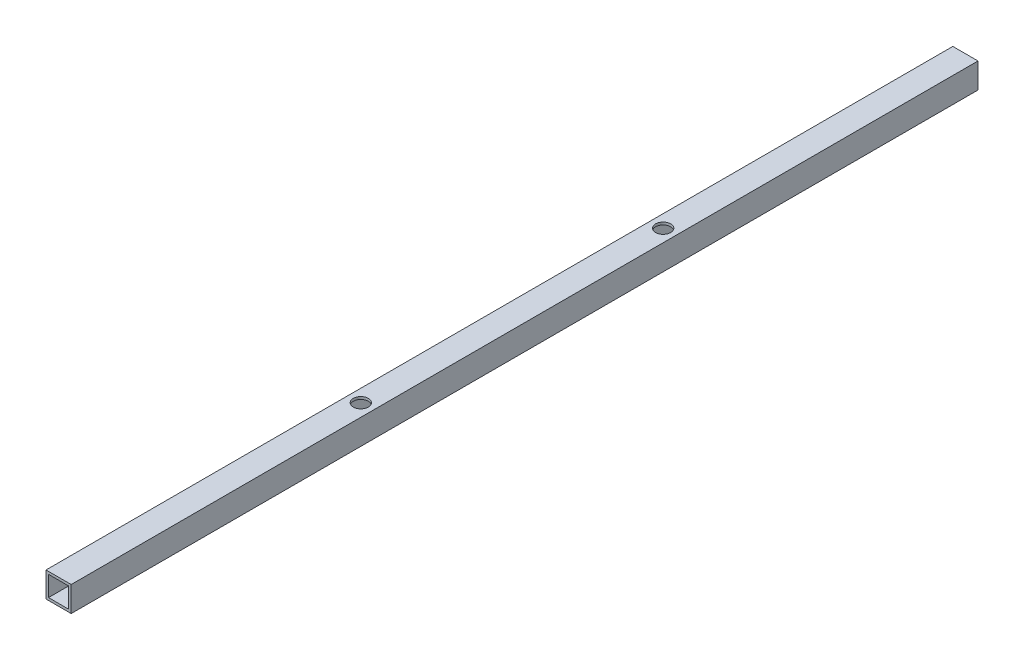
ISO-10303-21;
HEADER;
FILE_DESCRIPTION(('STEP AP214'),'2;1');
FILE_NAME('part.step','',(''),(''),'','','');
FILE_SCHEMA(('AUTOMOTIVE_DESIGN { 1 0 10303 214 1 1 1 1 }'));
ENDSEC;
DATA;
#1=APPLICATION_CONTEXT('core data for automotive mechanical design processes');
#2=APPLICATION_PROTOCOL_DEFINITION('international standard','automotive_design',2000,#1);
#3=PRODUCT_CONTEXT('',#1,'mechanical');
#4=PRODUCT('Part','Part','',(#3));
#5=PRODUCT_RELATED_PRODUCT_CATEGORY('part','',(#4));
#6=PRODUCT_DEFINITION_FORMATION('','',#4);
#7=PRODUCT_DEFINITION_CONTEXT('part definition',#1,'design');
#8=PRODUCT_DEFINITION('design','',#6,#7);
#9=PRODUCT_DEFINITION_SHAPE('','',#8);
#10=(LENGTH_UNIT() NAMED_UNIT(*) SI_UNIT(.MILLI.,.METRE.));
#11=(NAMED_UNIT(*) PLANE_ANGLE_UNIT() SI_UNIT($,.RADIAN.));
#12=(NAMED_UNIT(*) SI_UNIT($,.STERADIAN.) SOLID_ANGLE_UNIT());
#13=UNCERTAINTY_MEASURE_WITH_UNIT(LENGTH_MEASURE(1.E-05),#10,'distance_accuracy_value','');
#14=(GEOMETRIC_REPRESENTATION_CONTEXT(3) GLOBAL_UNCERTAINTY_ASSIGNED_CONTEXT((#13)) GLOBAL_UNIT_ASSIGNED_CONTEXT((#10,
#11,#12)) REPRESENTATION_CONTEXT('',''));
#15=CARTESIAN_POINT('',(0.,0.,0.));
#16=DIRECTION('',(0.,0.,1.));
#17=DIRECTION('',(1.,0.,0.));
#18=AXIS2_PLACEMENT_3D('',#15,#16,#17);
#19=CARTESIAN_POINT('',(4.99999999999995,5.00000000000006,360.));
#20=DIRECTION('',(-1.,0.,0.));
#21=DIRECTION('',(0.,-1.,0.));
#22=AXIS2_PLACEMENT_3D('',#19,#20,#21);
#23=PLANE('',#22);
#24=DIRECTION('',(0.,1.,0.));
#25=VECTOR('',#24,1.);
#26=CARTESIAN_POINT('',(4.99999999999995,5.00000000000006,0.));
#27=LINE('',#26,#25);
#28=CARTESIAN_POINT('',(4.99999999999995,-4.99999999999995,0.));
#29=VERTEX_POINT('',#28);
#30=CARTESIAN_POINT('',(4.99999999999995,5.00000000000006,0.));
#31=VERTEX_POINT('',#30);
#32=EDGE_CURVE('E151',#29,#31,#27,.T.);
#33=ORIENTED_EDGE('',*,*,#32,.T.);
#34=DIRECTION('',(0.,0.,-1.));
#35=VECTOR('',#34,1.);
#36=CARTESIAN_POINT('',(4.99999999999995,5.00000000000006,360.));
#37=LINE('',#36,#35);
#38=CARTESIAN_POINT('',(4.99999999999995,5.00000000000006,360.));
#39=VERTEX_POINT('',#38);
#40=EDGE_CURVE('E11',#39,#31,#37,.T.);
#41=ORIENTED_EDGE('',*,*,#40,.F.);
#42=DIRECTION('',(0.,1.,0.));
#43=VECTOR('',#42,1.);
#44=CARTESIAN_POINT('',(4.99999999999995,5.00000000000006,360.));
#45=LINE('',#44,#43);
#46=CARTESIAN_POINT('',(4.99999999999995,-4.99999999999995,360.));
#47=VERTEX_POINT('',#46);
#48=EDGE_CURVE('E157',#47,#39,#45,.T.);
#49=ORIENTED_EDGE('',*,*,#48,.F.);
#50=DIRECTION('',(0.,0.,-1.));
#51=VECTOR('',#50,1.);
#52=CARTESIAN_POINT('',(4.99999999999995,-4.99999999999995,360.));
#53=LINE('',#52,#51);
#54=EDGE_CURVE('E171',#47,#29,#53,.T.);
#55=ORIENTED_EDGE('',*,*,#54,.T.);
#56=EDGE_LOOP('',(#33,#41,#49,#55));
#57=FACE_BOUND('',#56,.T.);
#58=ADVANCED_FACE('F39',(#57),#23,.F.);
#59=CARTESIAN_POINT('',(-5.00000000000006,5.00000000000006,360.));
#60=DIRECTION('',(0.,-1.,0.));
#61=DIRECTION('',(0.,0.,-1.));
#62=AXIS2_PLACEMENT_3D('',#59,#60,#61);
#63=PLANE('',#62);
#64=CARTESIAN_POINT('',(0.,5.00000000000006,120.));
#65=DIRECTION('',(0.,1.,0.));
#66=DIRECTION('',(0.,0.,1.));
#67=AXIS2_PLACEMENT_3D('',#64,#65,#66);
#68=CIRCLE('',#67,3.);
#69=CARTESIAN_POINT('',(0.,5.00000000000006,123.));
#70=VERTEX_POINT('',#69);
#71=EDGE_CURVE('E142',#70,#70,#68,.T.);
#72=ORIENTED_EDGE('',*,*,#71,.F.);
#73=EDGE_LOOP('',(#72));
#74=FACE_BOUND('',#73,.T.);
#75=CARTESIAN_POINT('',(0.,5.00000000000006,240.));
#76=DIRECTION('',(0.,1.,0.));
#77=DIRECTION('',(0.,0.,1.));
#78=AXIS2_PLACEMENT_3D('',#75,#76,#77);
#79=CIRCLE('',#78,3.);
#80=CARTESIAN_POINT('',(0.,5.00000000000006,243.));
#81=VERTEX_POINT('',#80);
#82=EDGE_CURVE('E132',#81,#81,#79,.T.);
#83=ORIENTED_EDGE('',*,*,#82,.F.);
#84=EDGE_LOOP('',(#83));
#85=FACE_BOUND('',#84,.T.);
#86=DIRECTION('',(-1.,0.,0.));
#87=VECTOR('',#86,1.);
#88=CARTESIAN_POINT('',(-5.00000000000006,5.00000000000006,0.));
#89=LINE('',#88,#87);
#90=CARTESIAN_POINT('',(-5.00000000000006,5.00000000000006,0.));
#91=VERTEX_POINT('',#90);
#92=EDGE_CURVE('E175',#31,#91,#89,.T.);
#93=ORIENTED_EDGE('',*,*,#92,.T.);
#94=DIRECTION('',(0.,0.,-1.));
#95=VECTOR('',#94,1.);
#96=CARTESIAN_POINT('',(-5.00000000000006,5.00000000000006,360.));
#97=LINE('',#96,#95);
#98=CARTESIAN_POINT('',(-5.00000000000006,5.00000000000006,360.));
#99=VERTEX_POINT('',#98);
#100=EDGE_CURVE('E47',#99,#91,#97,.T.);
#101=ORIENTED_EDGE('',*,*,#100,.F.);
#102=DIRECTION('',(-1.,0.,0.));
#103=VECTOR('',#102,1.);
#104=CARTESIAN_POINT('',(-5.00000000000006,5.00000000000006,360.));
#105=LINE('',#104,#103);
#106=EDGE_CURVE('E161',#39,#99,#105,.T.);
#107=ORIENTED_EDGE('',*,*,#106,.F.);
#108=ORIENTED_EDGE('',*,*,#40,.T.);
#109=EDGE_LOOP('',(#93,#101,#107,#108));
#110=FACE_BOUND('',#109,.T.);
#111=ADVANCED_FACE('F209',(#74,#85,#110),#63,.F.);
#112=CARTESIAN_POINT('',(-5.00000000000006,5.00000000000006,360.));
#113=DIRECTION('',(1.,0.,0.));
#114=DIRECTION('',(0.,1.,0.));
#115=AXIS2_PLACEMENT_3D('',#112,#113,#114);
#116=PLANE('',#115);
#117=DIRECTION('',(0.,-1.,0.));
#118=VECTOR('',#117,1.);
#119=CARTESIAN_POINT('',(-5.00000000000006,5.00000000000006,0.));
#120=LINE('',#119,#118);
#121=CARTESIAN_POINT('',(-5.00000000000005,-4.99999999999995,0.));
#122=VERTEX_POINT('',#121);
#123=EDGE_CURVE('E178',#91,#122,#120,.T.);
#124=ORIENTED_EDGE('',*,*,#123,.T.);
#125=DIRECTION('',(0.,0.,-1.));
#126=VECTOR('',#125,1.);
#127=CARTESIAN_POINT('',(-5.00000000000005,-4.99999999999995,360.));
#128=LINE('',#127,#126);
#129=CARTESIAN_POINT('',(-5.00000000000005,-4.99999999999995,360.));
#130=VERTEX_POINT('',#129);
#131=EDGE_CURVE('E186',#130,#122,#128,.T.);
#132=ORIENTED_EDGE('',*,*,#131,.F.);
#133=DIRECTION('',(0.,-1.,0.));
#134=VECTOR('',#133,1.);
#135=CARTESIAN_POINT('',(-5.00000000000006,5.00000000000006,360.));
#136=LINE('',#135,#134);
#137=EDGE_CURVE('E165',#99,#130,#136,.T.);
#138=ORIENTED_EDGE('',*,*,#137,.F.);
#139=ORIENTED_EDGE('',*,*,#100,.T.);
#140=EDGE_LOOP('',(#124,#132,#138,#139));
#141=FACE_BOUND('',#140,.T.);
#142=ADVANCED_FACE('F195',(#141),#116,.F.);
#143=CARTESIAN_POINT('',(-5.00000000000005,-4.99999999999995,360.));
#144=DIRECTION('',(0.,1.,0.));
#145=DIRECTION('',(0.,0.,1.));
#146=AXIS2_PLACEMENT_3D('',#143,#144,#145);
#147=PLANE('',#146);
#148=DIRECTION('',(1.,0.,0.));
#149=VECTOR('',#148,1.);
#150=CARTESIAN_POINT('',(-5.00000000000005,-4.99999999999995,0.));
#151=LINE('',#150,#149);
#152=EDGE_CURVE('E162',#122,#29,#151,.T.);
#153=ORIENTED_EDGE('',*,*,#152,.T.);
#154=ORIENTED_EDGE('',*,*,#54,.F.);
#155=DIRECTION('',(1.,0.,0.));
#156=VECTOR('',#155,1.);
#157=CARTESIAN_POINT('',(-5.00000000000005,-4.99999999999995,360.));
#158=LINE('',#157,#156);
#159=EDGE_CURVE('E168',#130,#47,#158,.T.);
#160=ORIENTED_EDGE('',*,*,#159,.F.);
#161=ORIENTED_EDGE('',*,*,#131,.T.);
#162=EDGE_LOOP('',(#153,#154,#160,#161));
#163=FACE_BOUND('',#162,.T.);
#164=ADVANCED_FACE('F202',(#163),#147,.F.);
#165=CARTESIAN_POINT('',(0.,0.,360.));
#166=DIRECTION('',(0.,0.,1.));
#167=DIRECTION('',(1.,0.,0.));
#168=AXIS2_PLACEMENT_3D('',#165,#166,#167);
#169=PLANE('',#168);
#170=DIRECTION('',(0.,1.,0.));
#171=VECTOR('',#170,1.);
#172=CARTESIAN_POINT('',(4.,4.,360.));
#173=LINE('',#172,#171);
#174=CARTESIAN_POINT('',(4.,-4.,360.));
#175=VERTEX_POINT('',#174);
#176=CARTESIAN_POINT('',(4.,4.,360.));
#177=VERTEX_POINT('',#176);
#178=EDGE_CURVE('E54',#175,#177,#173,.T.);
#179=ORIENTED_EDGE('',*,*,#178,.F.);
#180=DIRECTION('',(1.,0.,0.));
#181=VECTOR('',#180,1.);
#182=CARTESIAN_POINT('',(-4.,-4.,360.));
#183=LINE('',#182,#181);
#184=CARTESIAN_POINT('',(-4.,-4.,360.));
#185=VERTEX_POINT('',#184);
#186=EDGE_CURVE('E125',#185,#175,#183,.T.);
#187=ORIENTED_EDGE('',*,*,#186,.F.);
#188=DIRECTION('',(0.,-1.,0.));
#189=VECTOR('',#188,1.);
#190=CARTESIAN_POINT('',(-4.,4.,360.));
#191=LINE('',#190,#189);
#192=CARTESIAN_POINT('',(-4.,4.,360.));
#193=VERTEX_POINT('',#192);
#194=EDGE_CURVE('E129',#193,#185,#191,.T.);
#195=ORIENTED_EDGE('',*,*,#194,.F.);
#196=DIRECTION('',(-1.,0.,0.));
#197=VECTOR('',#196,1.);
#198=CARTESIAN_POINT('',(-4.,4.,360.));
#199=LINE('',#198,#197);
#200=EDGE_CURVE('E141',#177,#193,#199,.T.);
#201=ORIENTED_EDGE('',*,*,#200,.F.);
#202=EDGE_LOOP('',(#179,#187,#195,#201));
#203=FACE_BOUND('',#202,.T.);
#204=ORIENTED_EDGE('',*,*,#48,.T.);
#205=ORIENTED_EDGE('',*,*,#106,.T.);
#206=ORIENTED_EDGE('',*,*,#137,.T.);
#207=ORIENTED_EDGE('',*,*,#159,.T.);
#208=EDGE_LOOP('',(#204,#205,#206,#207));
#209=FACE_BOUND('',#208,.T.);
#210=ADVANCED_FACE('F208',(#203,#209),#169,.T.);
#211=CARTESIAN_POINT('',(0.,0.,0.));
#212=DIRECTION('',(0.,0.,1.));
#213=DIRECTION('',(1.,0.,0.));
#214=AXIS2_PLACEMENT_3D('',#211,#212,#213);
#215=PLANE('',#214);
#216=DIRECTION('',(1.,0.,0.));
#217=VECTOR('',#216,1.);
#218=CARTESIAN_POINT('',(-4.,-4.,0.));
#219=LINE('',#218,#217);
#220=CARTESIAN_POINT('',(-4.,-4.,0.));
#221=VERTEX_POINT('',#220);
#222=CARTESIAN_POINT('',(4.,-4.,0.));
#223=VERTEX_POINT('',#222);
#224=EDGE_CURVE('E113',#221,#223,#219,.T.);
#225=ORIENTED_EDGE('',*,*,#224,.T.);
#226=DIRECTION('',(0.,1.,0.));
#227=VECTOR('',#226,1.);
#228=CARTESIAN_POINT('',(4.,4.,0.));
#229=LINE('',#228,#227);
#230=CARTESIAN_POINT('',(4.,4.,0.));
#231=VERTEX_POINT('',#230);
#232=EDGE_CURVE('E106',#223,#231,#229,.T.);
#233=ORIENTED_EDGE('',*,*,#232,.T.);
#234=DIRECTION('',(-1.,0.,0.));
#235=VECTOR('',#234,1.);
#236=CARTESIAN_POINT('',(-4.,4.,0.));
#237=LINE('',#236,#235);
#238=CARTESIAN_POINT('',(-4.,4.,0.));
#239=VERTEX_POINT('',#238);
#240=EDGE_CURVE('E116',#231,#239,#237,.T.);
#241=ORIENTED_EDGE('',*,*,#240,.T.);
#242=DIRECTION('',(0.,-1.,0.));
#243=VECTOR('',#242,1.);
#244=CARTESIAN_POINT('',(-4.,4.,0.));
#245=LINE('',#244,#243);
#246=EDGE_CURVE('E62',#239,#221,#245,.T.);
#247=ORIENTED_EDGE('',*,*,#246,.T.);
#248=EDGE_LOOP('',(#225,#233,#241,#247));
#249=FACE_BOUND('',#248,.T.);
#250=ORIENTED_EDGE('',*,*,#32,.F.);
#251=ORIENTED_EDGE('',*,*,#152,.F.);
#252=ORIENTED_EDGE('',*,*,#123,.F.);
#253=ORIENTED_EDGE('',*,*,#92,.F.);
#254=EDGE_LOOP('',(#250,#251,#252,#253));
#255=FACE_BOUND('',#254,.T.);
#256=ADVANCED_FACE('F121',(#249,#255),#215,.F.);
#257=CARTESIAN_POINT('',(4.,4.,0.));
#258=DIRECTION('',(1.,0.,0.));
#259=DIRECTION('',(0.,1.,0.));
#260=AXIS2_PLACEMENT_3D('',#257,#258,#259);
#261=PLANE('',#260);
#262=ORIENTED_EDGE('',*,*,#178,.T.);
#263=DIRECTION('',(0.,0.,1.));
#264=VECTOR('',#263,1.);
#265=CARTESIAN_POINT('',(4.,4.,0.));
#266=LINE('',#265,#264);
#267=EDGE_CURVE('E102',#231,#177,#266,.T.);
#268=ORIENTED_EDGE('',*,*,#267,.F.);
#269=ORIENTED_EDGE('',*,*,#232,.F.);
#270=DIRECTION('',(0.,0.,1.));
#271=VECTOR('',#270,1.);
#272=CARTESIAN_POINT('',(4.,-4.,0.));
#273=LINE('',#272,#271);
#274=EDGE_CURVE('E148',#223,#175,#273,.T.);
#275=ORIENTED_EDGE('',*,*,#274,.T.);
#276=EDGE_LOOP('',(#262,#268,#269,#275));
#277=FACE_BOUND('',#276,.T.);
#278=ADVANCED_FACE('F104',(#277),#261,.F.);
#279=CARTESIAN_POINT('',(-4.,-4.,0.));
#280=DIRECTION('',(0.,-1.,0.));
#281=DIRECTION('',(0.,0.,-1.));
#282=AXIS2_PLACEMENT_3D('',#279,#280,#281);
#283=PLANE('',#282);
#284=ORIENTED_EDGE('',*,*,#186,.T.);
#285=ORIENTED_EDGE('',*,*,#274,.F.);
#286=ORIENTED_EDGE('',*,*,#224,.F.);
#287=DIRECTION('',(0.,0.,1.));
#288=VECTOR('',#287,1.);
#289=CARTESIAN_POINT('',(-4.,-4.,0.));
#290=LINE('',#289,#288);
#291=EDGE_CURVE('E152',#221,#185,#290,.T.);
#292=ORIENTED_EDGE('',*,*,#291,.T.);
#293=EDGE_LOOP('',(#284,#285,#286,#292));
#294=FACE_BOUND('',#293,.T.);
#295=ADVANCED_FACE('F231',(#294),#283,.F.);
#296=CARTESIAN_POINT('',(-4.,4.,0.));
#297=DIRECTION('',(-1.,0.,0.));
#298=DIRECTION('',(0.,-1.,0.));
#299=AXIS2_PLACEMENT_3D('',#296,#297,#298);
#300=PLANE('',#299);
#301=ORIENTED_EDGE('',*,*,#194,.T.);
#302=ORIENTED_EDGE('',*,*,#291,.F.);
#303=ORIENTED_EDGE('',*,*,#246,.F.);
#304=DIRECTION('',(0.,0.,1.));
#305=VECTOR('',#304,1.);
#306=CARTESIAN_POINT('',(-4.,4.,0.));
#307=LINE('',#306,#305);
#308=EDGE_CURVE('E112',#239,#193,#307,.T.);
#309=ORIENTED_EDGE('',*,*,#308,.T.);
#310=EDGE_LOOP('',(#301,#302,#303,#309));
#311=FACE_BOUND('',#310,.T.);
#312=ADVANCED_FACE('F234',(#311),#300,.F.);
#313=CARTESIAN_POINT('',(-4.,4.,0.));
#314=DIRECTION('',(0.,1.,0.));
#315=DIRECTION('',(0.,0.,1.));
#316=AXIS2_PLACEMENT_3D('',#313,#314,#315);
#317=PLANE('',#316);
#318=CARTESIAN_POINT('',(0.,4.,120.));
#319=DIRECTION('',(0.,1.,0.));
#320=DIRECTION('',(0.,0.,1.));
#321=AXIS2_PLACEMENT_3D('',#318,#319,#320);
#322=CIRCLE('',#321,3.);
#323=CARTESIAN_POINT('',(0.,4.,123.));
#324=VERTEX_POINT('',#323);
#325=EDGE_CURVE('E253',#324,#324,#322,.F.);
#326=ORIENTED_EDGE('',*,*,#325,.F.);
#327=EDGE_LOOP('',(#326));
#328=FACE_BOUND('',#327,.T.);
#329=CARTESIAN_POINT('',(0.,4.,240.));
#330=DIRECTION('',(0.,1.,0.));
#331=DIRECTION('',(0.,0.,1.));
#332=AXIS2_PLACEMENT_3D('',#329,#330,#331);
#333=CIRCLE('',#332,3.);
#334=CARTESIAN_POINT('',(0.,4.,243.));
#335=VERTEX_POINT('',#334);
#336=EDGE_CURVE('E260',#335,#335,#333,.F.);
#337=ORIENTED_EDGE('',*,*,#336,.F.);
#338=EDGE_LOOP('',(#337));
#339=FACE_BOUND('',#338,.T.);
#340=ORIENTED_EDGE('',*,*,#200,.T.);
#341=ORIENTED_EDGE('',*,*,#308,.F.);
#342=ORIENTED_EDGE('',*,*,#240,.F.);
#343=ORIENTED_EDGE('',*,*,#267,.T.);
#344=EDGE_LOOP('',(#340,#341,#342,#343));
#345=FACE_BOUND('',#344,.T.);
#346=ADVANCED_FACE('F117',(#328,#339,#345),#317,.F.);
#347=CARTESIAN_POINT('',(0.,-5.00099999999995,240.));
#348=DIRECTION('',(0.,1.,0.));
#349=DIRECTION('',(0.,0.,1.));
#350=AXIS2_PLACEMENT_3D('',#347,#348,#349);
#351=CYLINDRICAL_SURFACE('',#350,3.);
#352=CARTESIAN_POINT('',(0.,5.00000000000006,243.));
#353=CARTESIAN_POINT('',(0.,4.98958333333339,243.));
#354=CARTESIAN_POINT('',(0.,4.97916666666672,243.));
#355=CARTESIAN_POINT('',(0.,4.95833333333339,243.));
#356=CARTESIAN_POINT('',(0.,4.94791666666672,243.));
#357=CARTESIAN_POINT('',(0.,4.92708333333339,243.));
#358=CARTESIAN_POINT('',(0.,4.91666666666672,243.));
#359=CARTESIAN_POINT('',(0.,4.89583333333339,243.));
#360=CARTESIAN_POINT('',(0.,4.88541666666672,243.));
#361=CARTESIAN_POINT('',(0.,4.86458333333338,243.));
#362=CARTESIAN_POINT('',(0.,4.85416666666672,243.));
#363=CARTESIAN_POINT('',(0.,4.83333333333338,243.));
#364=CARTESIAN_POINT('',(0.,4.82291666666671,243.));
#365=CARTESIAN_POINT('',(0.,4.80208333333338,243.));
#366=CARTESIAN_POINT('',(0.,4.79166666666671,243.));
#367=CARTESIAN_POINT('',(0.,4.77083333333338,243.));
#368=CARTESIAN_POINT('',(0.,4.76041666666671,243.));
#369=CARTESIAN_POINT('',(0.,4.73958333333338,243.));
#370=CARTESIAN_POINT('',(0.,4.72916666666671,243.));
#371=CARTESIAN_POINT('',(0.,4.70833333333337,243.));
#372=CARTESIAN_POINT('',(0.,4.69791666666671,243.));
#373=CARTESIAN_POINT('',(0.,4.67708333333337,243.));
#374=CARTESIAN_POINT('',(0.,4.6666666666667,243.));
#375=CARTESIAN_POINT('',(0.,4.64583333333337,243.));
#376=CARTESIAN_POINT('',(0.,4.6354166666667,243.));
#377=CARTESIAN_POINT('',(0.,4.61458333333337,243.));
#378=CARTESIAN_POINT('',(0.,4.6041666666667,243.));
#379=CARTESIAN_POINT('',(0.,4.58333333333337,243.));
#380=CARTESIAN_POINT('',(0.,4.5729166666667,243.));
#381=CARTESIAN_POINT('',(0.,4.55208333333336,243.));
#382=CARTESIAN_POINT('',(0.,4.5416666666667,243.));
#383=CARTESIAN_POINT('',(0.,4.52083333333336,243.));
#384=CARTESIAN_POINT('',(0.,4.5104166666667,243.));
#385=CARTESIAN_POINT('',(0.,4.48958333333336,243.));
#386=CARTESIAN_POINT('',(0.,4.47916666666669,243.));
#387=CARTESIAN_POINT('',(0.,4.45833333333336,243.));
#388=CARTESIAN_POINT('',(0.,4.44791666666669,243.));
#389=CARTESIAN_POINT('',(0.,4.42708333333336,243.));
#390=CARTESIAN_POINT('',(0.,4.41666666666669,243.));
#391=CARTESIAN_POINT('',(0.,4.39583333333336,243.));
#392=CARTESIAN_POINT('',(0.,4.38541666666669,243.));
#393=CARTESIAN_POINT('',(0.,4.36458333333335,243.));
#394=CARTESIAN_POINT('',(0.,4.35416666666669,243.));
#395=CARTESIAN_POINT('',(0.,4.33333333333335,243.));
#396=CARTESIAN_POINT('',(0.,4.32291666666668,243.));
#397=CARTESIAN_POINT('',(0.,4.30208333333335,243.));
#398=CARTESIAN_POINT('',(0.,4.29166666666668,243.));
#399=CARTESIAN_POINT('',(0.,4.27083333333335,243.));
#400=CARTESIAN_POINT('',(0.,4.26041666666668,243.));
#401=CARTESIAN_POINT('',(0.,4.23958333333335,243.));
#402=CARTESIAN_POINT('',(0.,4.22916666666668,243.));
#403=CARTESIAN_POINT('',(0.,4.20833333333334,243.));
#404=CARTESIAN_POINT('',(0.,4.19791666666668,243.));
#405=CARTESIAN_POINT('',(0.,4.17708333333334,243.));
#406=CARTESIAN_POINT('',(0.,4.16666666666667,243.));
#407=CARTESIAN_POINT('',(0.,4.14583333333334,243.));
#408=CARTESIAN_POINT('',(0.,4.13541666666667,243.));
#409=CARTESIAN_POINT('',(0.,4.11458333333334,243.));
#410=CARTESIAN_POINT('',(0.,4.10416666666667,243.));
#411=CARTESIAN_POINT('',(0.,4.08333333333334,243.));
#412=CARTESIAN_POINT('',(0.,4.07291666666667,243.));
#413=CARTESIAN_POINT('',(0.,4.05208333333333,243.));
#414=CARTESIAN_POINT('',(0.,4.04166666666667,243.));
#415=CARTESIAN_POINT('',(0.,4.02083333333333,243.));
#416=CARTESIAN_POINT('',(0.,4.01041666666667,243.));
#417=CARTESIAN_POINT('',(0.,4.,243.));
#418=B_SPLINE_CURVE_WITH_KNOTS('',3,(#352,#353,#354,#355,#356,#357,#358,#359,#360,#361,#362,
#363,#364,#365,#366,#367,#368,#369,#370,#371,#372,#373,#374,#375,#376,#377,#378,#379,#380,#381,
#382,#383,#384,#385,#386,#387,#388,#389,#390,#391,#392,#393,#394,#395,#396,#397,#398,#399,#400,
#401,#402,#403,#404,#405,#406,#407,#408,#409,#410,#411,#412,#413,#414,#415,#416,#417),
.UNSPECIFIED.,.F.,.F.,(4,2,2,2,2,2,2,2,2,2,2,2,2,2,2,2,2,2,2,2,2,2,2,2,2,2,2,2,2,2,2,2,4),(0.,
0.0312500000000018,0.0625000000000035,0.0937500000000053,0.125000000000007,0.156250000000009,
0.187500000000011,0.218750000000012,0.250000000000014,0.281250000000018,0.312500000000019,
0.343750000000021,0.375000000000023,0.406250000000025,0.437500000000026,0.468750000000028,
0.50000000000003,0.531250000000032,0.562500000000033,0.593750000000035,0.625000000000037,
0.656250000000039,0.687500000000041,0.718750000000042,0.750000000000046,0.781250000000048,
0.812500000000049,0.843750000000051,0.875000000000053,0.906250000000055,0.937500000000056,
0.968750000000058,1.00000000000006),.UNSPECIFIED.);
#419=EDGE_CURVE('BSEAM233',#81,#335,#418,.T.);
#420=ORIENTED_EDGE('',*,*,#82,.T.);
#421=ORIENTED_EDGE('',*,*,#336,.T.);
#422=ORIENTED_EDGE('',*,*,#419,.T.);
#423=ORIENTED_EDGE('',*,*,#419,.F.);
#424=EDGE_LOOP('',(#420,#422,#421,#423));
#425=FACE_BOUND('',#424,.T.);
#426=ADVANCED_FACE('F233',(#425),#351,.F.);
#427=CARTESIAN_POINT('',(0.,-5.00099999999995,120.));
#428=DIRECTION('',(0.,1.,0.));
#429=DIRECTION('',(0.,0.,1.));
#430=AXIS2_PLACEMENT_3D('',#427,#428,#429);
#431=CYLINDRICAL_SURFACE('',#430,3.);
#432=CARTESIAN_POINT('',(0.,5.00000000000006,123.));
#433=CARTESIAN_POINT('',(0.,4.98958333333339,123.));
#434=CARTESIAN_POINT('',(0.,4.97916666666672,123.));
#435=CARTESIAN_POINT('',(0.,4.95833333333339,123.));
#436=CARTESIAN_POINT('',(0.,4.94791666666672,123.));
#437=CARTESIAN_POINT('',(0.,4.92708333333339,123.));
#438=CARTESIAN_POINT('',(0.,4.91666666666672,123.));
#439=CARTESIAN_POINT('',(0.,4.89583333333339,123.));
#440=CARTESIAN_POINT('',(0.,4.88541666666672,123.));
#441=CARTESIAN_POINT('',(0.,4.86458333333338,123.));
#442=CARTESIAN_POINT('',(0.,4.85416666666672,123.));
#443=CARTESIAN_POINT('',(0.,4.83333333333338,123.));
#444=CARTESIAN_POINT('',(0.,4.82291666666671,123.));
#445=CARTESIAN_POINT('',(0.,4.80208333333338,123.));
#446=CARTESIAN_POINT('',(0.,4.79166666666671,123.));
#447=CARTESIAN_POINT('',(0.,4.77083333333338,123.));
#448=CARTESIAN_POINT('',(0.,4.76041666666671,123.));
#449=CARTESIAN_POINT('',(0.,4.73958333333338,123.));
#450=CARTESIAN_POINT('',(0.,4.72916666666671,123.));
#451=CARTESIAN_POINT('',(0.,4.70833333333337,123.));
#452=CARTESIAN_POINT('',(0.,4.69791666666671,123.));
#453=CARTESIAN_POINT('',(0.,4.67708333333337,123.));
#454=CARTESIAN_POINT('',(0.,4.6666666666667,123.));
#455=CARTESIAN_POINT('',(0.,4.64583333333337,123.));
#456=CARTESIAN_POINT('',(0.,4.6354166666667,123.));
#457=CARTESIAN_POINT('',(0.,4.61458333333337,123.));
#458=CARTESIAN_POINT('',(0.,4.6041666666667,123.));
#459=CARTESIAN_POINT('',(0.,4.58333333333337,123.));
#460=CARTESIAN_POINT('',(0.,4.5729166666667,123.));
#461=CARTESIAN_POINT('',(0.,4.55208333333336,123.));
#462=CARTESIAN_POINT('',(0.,4.5416666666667,123.));
#463=CARTESIAN_POINT('',(0.,4.52083333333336,123.));
#464=CARTESIAN_POINT('',(0.,4.5104166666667,123.));
#465=CARTESIAN_POINT('',(0.,4.48958333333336,123.));
#466=CARTESIAN_POINT('',(0.,4.47916666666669,123.));
#467=CARTESIAN_POINT('',(0.,4.45833333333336,123.));
#468=CARTESIAN_POINT('',(0.,4.44791666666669,123.));
#469=CARTESIAN_POINT('',(0.,4.42708333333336,123.));
#470=CARTESIAN_POINT('',(0.,4.41666666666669,123.));
#471=CARTESIAN_POINT('',(0.,4.39583333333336,123.));
#472=CARTESIAN_POINT('',(0.,4.38541666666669,123.));
#473=CARTESIAN_POINT('',(0.,4.36458333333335,123.));
#474=CARTESIAN_POINT('',(0.,4.35416666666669,123.));
#475=CARTESIAN_POINT('',(0.,4.33333333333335,123.));
#476=CARTESIAN_POINT('',(0.,4.32291666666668,123.));
#477=CARTESIAN_POINT('',(0.,4.30208333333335,123.));
#478=CARTESIAN_POINT('',(0.,4.29166666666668,123.));
#479=CARTESIAN_POINT('',(0.,4.27083333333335,123.));
#480=CARTESIAN_POINT('',(0.,4.26041666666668,123.));
#481=CARTESIAN_POINT('',(0.,4.23958333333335,123.));
#482=CARTESIAN_POINT('',(0.,4.22916666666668,123.));
#483=CARTESIAN_POINT('',(0.,4.20833333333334,123.));
#484=CARTESIAN_POINT('',(0.,4.19791666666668,123.));
#485=CARTESIAN_POINT('',(0.,4.17708333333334,123.));
#486=CARTESIAN_POINT('',(0.,4.16666666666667,123.));
#487=CARTESIAN_POINT('',(0.,4.14583333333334,123.));
#488=CARTESIAN_POINT('',(0.,4.13541666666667,123.));
#489=CARTESIAN_POINT('',(0.,4.11458333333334,123.));
#490=CARTESIAN_POINT('',(0.,4.10416666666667,123.));
#491=CARTESIAN_POINT('',(0.,4.08333333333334,123.));
#492=CARTESIAN_POINT('',(0.,4.07291666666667,123.));
#493=CARTESIAN_POINT('',(0.,4.05208333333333,123.));
#494=CARTESIAN_POINT('',(0.,4.04166666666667,123.));
#495=CARTESIAN_POINT('',(0.,4.02083333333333,123.));
#496=CARTESIAN_POINT('',(0.,4.01041666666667,123.));
#497=CARTESIAN_POINT('',(0.,4.,123.));
#498=B_SPLINE_CURVE_WITH_KNOTS('',3,(#432,#433,#434,#435,#436,#437,#438,#439,#440,#441,#442,
#443,#444,#445,#446,#447,#448,#449,#450,#451,#452,#453,#454,#455,#456,#457,#458,#459,#460,#461,
#462,#463,#464,#465,#466,#467,#468,#469,#470,#471,#472,#473,#474,#475,#476,#477,#478,#479,#480,
#481,#482,#483,#484,#485,#486,#487,#488,#489,#490,#491,#492,#493,#494,#495,#496,#497),
.UNSPECIFIED.,.F.,.F.,(4,2,2,2,2,2,2,2,2,2,2,2,2,2,2,2,2,2,2,2,2,2,2,2,2,2,2,2,2,2,2,2,4),(0.,
0.0312500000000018,0.0625000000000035,0.0937500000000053,0.125000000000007,0.156250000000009,
0.187500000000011,0.218750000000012,0.250000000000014,0.281250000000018,0.312500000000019,
0.343750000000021,0.375000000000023,0.406250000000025,0.437500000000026,0.468750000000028,
0.50000000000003,0.531250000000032,0.562500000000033,0.593750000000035,0.625000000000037,
0.656250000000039,0.687500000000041,0.718750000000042,0.750000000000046,0.781250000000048,
0.812500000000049,0.843750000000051,0.875000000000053,0.906250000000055,0.937500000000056,
0.968750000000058,1.00000000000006),.UNSPECIFIED.);
#499=EDGE_CURVE('BSEAM243',#70,#324,#498,.T.);
#500=ORIENTED_EDGE('',*,*,#71,.T.);
#501=ORIENTED_EDGE('',*,*,#325,.T.);
#502=ORIENTED_EDGE('',*,*,#499,.T.);
#503=ORIENTED_EDGE('',*,*,#499,.F.);
#504=EDGE_LOOP('',(#500,#502,#501,#503));
#505=FACE_BOUND('',#504,.T.);
#506=ADVANCED_FACE('F243',(#505),#431,.F.);
#507=CLOSED_SHELL('',(#58,#111,#142,#164,#210,#256,#278,#295,#312,#346,#426,#506));
#508=MANIFOLD_SOLID_BREP('B2',#507);
#509=ADVANCED_BREP_SHAPE_REPRESENTATION('',(#18,#508),#14);
#510=SHAPE_DEFINITION_REPRESENTATION(#9,#509);
ENDSEC;
END-ISO-10303-21;
